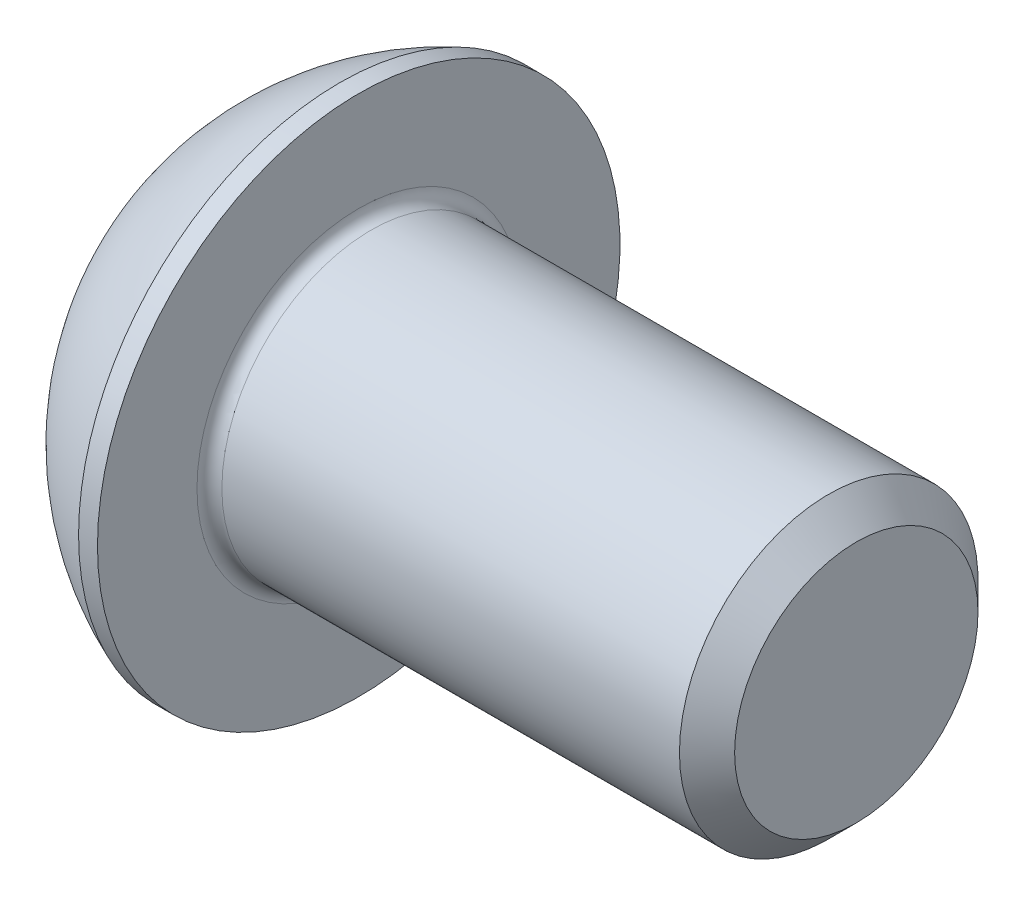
from build123d import *

# Parameters (mm, degrees)
FILLET1_R   = 0.25
HEX_2_DEPTH = 2.08


with BuildPart() as part:
    # BodySke → BaseBody (revolve)
    with BuildSketch(Plane.XY, mode=Mode.PRIVATE) as basebody_sk:
        with BuildLine():
            Line((13.3, 0), (13.3, 2.4455))
            Line((13.3, 2.4455), (12.7455, 3))
            Line((12.7455, 3), (3.3, 3))
            Line((3.3, 3), (3.3, 5.25))
            Line((3.3, 5.25), (2.92, 5.25))
            ThreePointArc((2.92, 5.25), (1.224500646, 4.199464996), (0, 2.625))
            Line((0, 2.625), (0, 0))
            Line((0, 0), (13.3, 0))
        make_face()
    revolve(basebody_sk.sketch.rotate(Axis((0, 0, 0), (1, 0, 0)), 90), axis=Axis((0, 0, 0), (1, 0, 0)))

    # Fillet1
    fillet1_edges = [part.edges().sort_by_distance(p)[0] for p in [
        (3.3, 0, -3),
    ]]
    fillet(fillet1_edges, radius=FILLET1_R)

    # Sketch2 → PreBroach (revolve, cut)
    with BuildSketch(Plane.XY, mode=Mode.PRIVATE) as prebroach_sk:
        Polygon((0, 2), (2.08, 2), (3.234700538, 0), (0, 0), align=None)
    revolve(prebroach_sk.sketch.rotate(Axis((0, 0, 0), (1, 0, 0)), 90), axis=Axis((0, 0, 0), (1, 0, 0)), mode=Mode.SUBTRACT)

    # Sketch3 → Hex 2 (cut)
    with BuildSketch(Plane(origin=(0, 0, 0), x_dir=(0, 0, -1), z_dir=(1, 0, 0))):
        Polygon((-2, -1.154700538), (-2, 1.154700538), (0, 2.309401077), (2, 1.154700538), (2, -1.154700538), (0, -2.309401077), align=None)
    extrude(amount=HEX_2_DEPTH, mode=Mode.SUBTRACT)


solid = part.part
